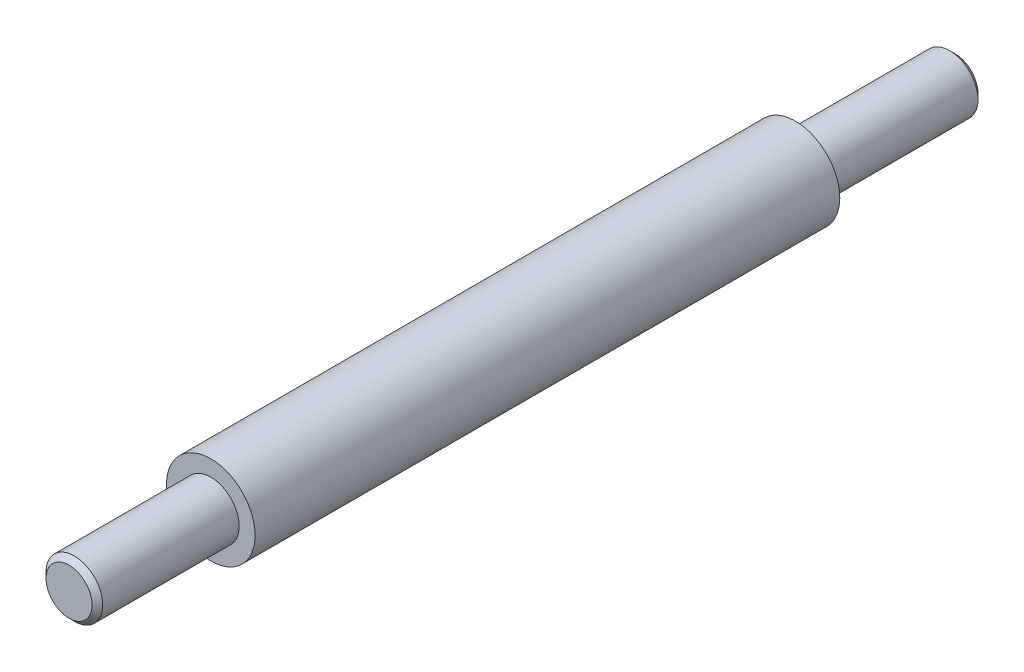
ISO-10303-21;
HEADER;
FILE_DESCRIPTION(('STEP AP214'),'2;1');
FILE_NAME('part.step','',(''),(''),'','','');
FILE_SCHEMA(('AUTOMOTIVE_DESIGN { 1 0 10303 214 1 1 1 1 }'));
ENDSEC;
DATA;
#1=APPLICATION_CONTEXT('core data for automotive mechanical design processes');
#2=APPLICATION_PROTOCOL_DEFINITION('international standard','automotive_design',2000,#1);
#3=PRODUCT_CONTEXT('',#1,'mechanical');
#4=PRODUCT('Part','Part','',(#3));
#5=PRODUCT_RELATED_PRODUCT_CATEGORY('part','',(#4));
#6=PRODUCT_DEFINITION_FORMATION('','',#4);
#7=PRODUCT_DEFINITION_CONTEXT('part definition',#1,'design');
#8=PRODUCT_DEFINITION('design','',#6,#7);
#9=PRODUCT_DEFINITION_SHAPE('','',#8);
#10=(LENGTH_UNIT() NAMED_UNIT(*) SI_UNIT(.MILLI.,.METRE.));
#11=(NAMED_UNIT(*) PLANE_ANGLE_UNIT() SI_UNIT($,.RADIAN.));
#12=(NAMED_UNIT(*) SI_UNIT($,.STERADIAN.) SOLID_ANGLE_UNIT());
#13=UNCERTAINTY_MEASURE_WITH_UNIT(LENGTH_MEASURE(1.E-05),#10,'distance_accuracy_value','');
#14=(GEOMETRIC_REPRESENTATION_CONTEXT(3) GLOBAL_UNCERTAINTY_ASSIGNED_CONTEXT((#13)) GLOBAL_UNIT_ASSIGNED_CONTEXT((#10,
#11,#12)) REPRESENTATION_CONTEXT('',''));
#15=CARTESIAN_POINT('',(0.,0.,0.));
#16=DIRECTION('',(0.,0.,1.));
#17=DIRECTION('',(1.,0.,0.));
#18=AXIS2_PLACEMENT_3D('',#15,#16,#17);
#19=CARTESIAN_POINT('',(0.,0.,165.));
#20=DIRECTION('',(0.,0.,-1.));
#21=DIRECTION('',(-1.,0.,0.));
#22=AXIS2_PLACEMENT_3D('',#19,#20,#21);
#23=CYLINDRICAL_SURFACE('',#22,12.5);
#24=CARTESIAN_POINT('',(0.,0.,165.));
#25=DIRECTION('',(0.,0.,1.));
#26=DIRECTION('',(1.,0.,0.));
#27=AXIS2_PLACEMENT_3D('',#24,#25,#26);
#28=CIRCLE('',#27,12.5);
#29=CARTESIAN_POINT('',(12.5,0.,165.));
#30=VERTEX_POINT('',#29);
#31=EDGE_CURVE('E54',#30,#30,#28,.T.);
#32=ORIENTED_EDGE('',*,*,#31,.F.);
#33=EDGE_LOOP('',(#32));
#34=FACE_BOUND('',#33,.T.);
#35=CARTESIAN_POINT('',(0.,0.,0.));
#36=DIRECTION('',(0.,0.,1.));
#37=DIRECTION('',(1.,0.,0.));
#38=AXIS2_PLACEMENT_3D('',#35,#36,#37);
#39=CIRCLE('',#38,12.5);
#40=CARTESIAN_POINT('',(12.5,0.,0.));
#41=VERTEX_POINT('',#40);
#42=EDGE_CURVE('E55',#41,#41,#39,.T.);
#43=ORIENTED_EDGE('',*,*,#42,.T.);
#44=EDGE_LOOP('',(#43));
#45=FACE_BOUND('',#44,.T.);
#46=ADVANCED_FACE('F31',(#34,#45),#23,.T.);
#47=CARTESIAN_POINT('',(0.,0.,165.));
#48=DIRECTION('',(0.,0.,1.));
#49=DIRECTION('',(1.,0.,0.));
#50=AXIS2_PLACEMENT_3D('',#47,#48,#49);
#51=PLANE('',#50);
#52=CARTESIAN_POINT('',(0.,0.,165.));
#53=DIRECTION('',(0.,0.,1.));
#54=DIRECTION('',(1.,0.,0.));
#55=AXIS2_PLACEMENT_3D('',#52,#53,#54);
#56=CIRCLE('',#55,8.);
#57=CARTESIAN_POINT('',(8.,0.,165.));
#58=VERTEX_POINT('',#57);
#59=EDGE_CURVE('E58',#58,#58,#56,.T.);
#60=ORIENTED_EDGE('',*,*,#59,.F.);
#61=EDGE_LOOP('',(#60));
#62=FACE_BOUND('',#61,.T.);
#63=ORIENTED_EDGE('',*,*,#31,.T.);
#64=EDGE_LOOP('',(#63));
#65=FACE_BOUND('',#64,.T.);
#66=ADVANCED_FACE('F66',(#62,#65),#51,.T.);
#67=CARTESIAN_POINT('',(0.,0.,0.));
#68=DIRECTION('',(0.,0.,1.));
#69=DIRECTION('',(1.,0.,0.));
#70=AXIS2_PLACEMENT_3D('',#67,#68,#69);
#71=PLANE('',#70);
#72=CARTESIAN_POINT('',(0.,0.,0.));
#73=DIRECTION('',(0.,0.,1.));
#74=DIRECTION('',(1.,0.,0.));
#75=AXIS2_PLACEMENT_3D('',#72,#73,#74);
#76=CIRCLE('',#75,8.);
#77=CARTESIAN_POINT('',(8.,0.,0.));
#78=VERTEX_POINT('',#77);
#79=EDGE_CURVE('E51',#78,#78,#76,.F.);
#80=ORIENTED_EDGE('',*,*,#79,.F.);
#81=EDGE_LOOP('',(#80));
#82=FACE_BOUND('',#81,.T.);
#83=ORIENTED_EDGE('',*,*,#42,.F.);
#84=EDGE_LOOP('',(#83));
#85=FACE_BOUND('',#84,.T.);
#86=ADVANCED_FACE('F69',(#82,#85),#71,.F.);
#87=CARTESIAN_POINT('',(0.,0.,-45.));
#88=DIRECTION('',(0.,0.,1.));
#89=DIRECTION('',(1.,0.,0.));
#90=AXIS2_PLACEMENT_3D('',#87,#88,#89);
#91=CYLINDRICAL_SURFACE('',#90,8.);
#92=CARTESIAN_POINT('',(0.,0.,-43.5000000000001));
#93=DIRECTION('',(0.,0.,-1.));
#94=DIRECTION('',(-1.,0.,0.));
#95=AXIS2_PLACEMENT_3D('',#92,#93,#94);
#96=CIRCLE('',#95,8.);
#97=CARTESIAN_POINT('',(8.,0.,-43.5000000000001));
#98=VERTEX_POINT('',#97);
#99=EDGE_CURVE('E42',#98,#98,#96,.F.);
#100=CARTESIAN_POINT('',(8.,0.,-43.5000000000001));
#101=CARTESIAN_POINT('',(8.,0.,-43.0468750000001));
#102=CARTESIAN_POINT('',(8.,0.,-42.5937500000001));
#103=CARTESIAN_POINT('',(8.,0.,-41.6875000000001));
#104=CARTESIAN_POINT('',(8.,0.,-41.2343750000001));
#105=CARTESIAN_POINT('',(8.,0.,-40.3281250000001));
#106=CARTESIAN_POINT('',(8.,0.,-39.8750000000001));
#107=CARTESIAN_POINT('',(8.,0.,-38.9687500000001));
#108=CARTESIAN_POINT('',(8.,0.,-38.5156250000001));
#109=CARTESIAN_POINT('',(8.,0.,-37.6093750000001));
#110=CARTESIAN_POINT('',(8.,0.,-37.1562500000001));
#111=CARTESIAN_POINT('',(8.,0.,-36.2500000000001));
#112=CARTESIAN_POINT('',(8.,0.,-35.7968750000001));
#113=CARTESIAN_POINT('',(8.,0.,-34.8906250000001));
#114=CARTESIAN_POINT('',(8.,0.,-34.4375000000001));
#115=CARTESIAN_POINT('',(8.,0.,-33.5312500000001));
#116=CARTESIAN_POINT('',(8.,0.,-33.0781250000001));
#117=CARTESIAN_POINT('',(8.,0.,-32.1718750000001));
#118=CARTESIAN_POINT('',(8.,0.,-31.7187500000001));
#119=CARTESIAN_POINT('',(8.,0.,-30.8125000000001));
#120=CARTESIAN_POINT('',(8.,0.,-30.3593750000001));
#121=CARTESIAN_POINT('',(8.,0.,-29.4531250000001));
#122=CARTESIAN_POINT('',(8.,0.,-29.0000000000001));
#123=CARTESIAN_POINT('',(8.,0.,-28.0937500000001));
#124=CARTESIAN_POINT('',(8.,0.,-27.6406250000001));
#125=CARTESIAN_POINT('',(8.,0.,-26.7343750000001));
#126=CARTESIAN_POINT('',(8.,0.,-26.2812500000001));
#127=CARTESIAN_POINT('',(8.,0.,-25.3750000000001));
#128=CARTESIAN_POINT('',(8.,0.,-24.9218750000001));
#129=CARTESIAN_POINT('',(8.,0.,-24.0156250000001));
#130=CARTESIAN_POINT('',(8.,0.,-23.5625000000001));
#131=CARTESIAN_POINT('',(8.,0.,-22.6562500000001));
#132=CARTESIAN_POINT('',(8.,0.,-22.2031250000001));
#133=CARTESIAN_POINT('',(8.,0.,-21.2968750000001));
#134=CARTESIAN_POINT('',(8.,0.,-20.8437500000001));
#135=CARTESIAN_POINT('',(8.,0.,-19.9375000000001));
#136=CARTESIAN_POINT('',(8.,0.,-19.4843750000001));
#137=CARTESIAN_POINT('',(8.,0.,-18.5781250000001));
#138=CARTESIAN_POINT('',(8.,0.,-18.1250000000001));
#139=CARTESIAN_POINT('',(8.,0.,-17.21875));
#140=CARTESIAN_POINT('',(8.,0.,-16.765625));
#141=CARTESIAN_POINT('',(8.,0.,-15.859375));
#142=CARTESIAN_POINT('',(8.,0.,-15.40625));
#143=CARTESIAN_POINT('',(8.,0.,-14.5));
#144=CARTESIAN_POINT('',(8.,0.,-14.046875));
#145=CARTESIAN_POINT('',(8.,0.,-13.140625));
#146=CARTESIAN_POINT('',(8.,0.,-12.6875));
#147=CARTESIAN_POINT('',(8.,0.,-11.78125));
#148=CARTESIAN_POINT('',(8.,0.,-11.328125));
#149=CARTESIAN_POINT('',(8.,0.,-10.421875));
#150=CARTESIAN_POINT('',(8.,0.,-9.96875000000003));
#151=CARTESIAN_POINT('',(8.,0.,-9.06250000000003));
#152=CARTESIAN_POINT('',(8.,0.,-8.60937500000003));
#153=CARTESIAN_POINT('',(8.,0.,-7.70312500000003));
#154=CARTESIAN_POINT('',(8.,0.,-7.25000000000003));
#155=CARTESIAN_POINT('',(8.,0.,-6.34375000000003));
#156=CARTESIAN_POINT('',(8.,0.,-5.89062500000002));
#157=CARTESIAN_POINT('',(8.,0.,-4.98437500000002));
#158=CARTESIAN_POINT('',(8.,0.,-4.53125000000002));
#159=CARTESIAN_POINT('',(8.,0.,-3.62500000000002));
#160=CARTESIAN_POINT('',(8.,0.,-3.17187500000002));
#161=CARTESIAN_POINT('',(8.,0.,-2.26562500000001));
#162=CARTESIAN_POINT('',(8.,0.,-1.81250000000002));
#163=CARTESIAN_POINT('',(8.,0.,-0.906250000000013));
#164=CARTESIAN_POINT('',(8.,0.,-0.45312500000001));
#165=CARTESIAN_POINT('',(8.,0.,0.));
#166=B_SPLINE_CURVE_WITH_KNOTS('',3,(#100,#101,#102,#103,#104,#105,#106,#107,#108,#109,#110,
#111,#112,#113,#114,#115,#116,#117,#118,#119,#120,#121,#122,#123,#124,#125,#126,#127,#128,#129,
#130,#131,#132,#133,#134,#135,#136,#137,#138,#139,#140,#141,#142,#143,#144,#145,#146,#147,#148,
#149,#150,#151,#152,#153,#154,#155,#156,#157,#158,#159,#160,#161,#162,#163,#164,#165),
.UNSPECIFIED.,.F.,.F.,(4,2,2,2,2,2,2,2,2,2,2,2,2,2,2,2,2,2,2,2,2,2,2,2,2,2,2,2,2,2,2,2,4),(0.,
1.359375,2.71875000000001,4.07812500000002,5.43750000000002,6.79687500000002,8.15625000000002,
9.51562500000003,10.875,12.234375,13.59375,14.953125,16.3125,17.671875,19.03125,20.390625,
21.7500000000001,23.1093750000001,24.4687500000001,25.8281250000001,27.1875000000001,
28.5468750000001,29.9062500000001,31.2656250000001,32.6250000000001,33.9843750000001,
35.3437500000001,36.7031250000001,38.0625000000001,39.4218750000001,40.7812500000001,
42.1406250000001,43.5000000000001),.UNSPECIFIED.);
#167=EDGE_CURVE('BSEAM79',#98,#78,#166,.T.);
#168=ORIENTED_EDGE('',*,*,#99,.T.);
#169=ORIENTED_EDGE('',*,*,#79,.T.);
#170=ORIENTED_EDGE('',*,*,#167,.T.);
#171=ORIENTED_EDGE('',*,*,#167,.F.);
#172=EDGE_LOOP('',(#168,#170,#169,#171));
#173=FACE_BOUND('',#172,.T.);
#174=ADVANCED_FACE('F79',(#173),#91,.T.);
#175=CARTESIAN_POINT('',(0.,0.,-45.));
#176=DIRECTION('',(0.,0.,-1.));
#177=DIRECTION('',(-1.,0.,0.));
#178=AXIS2_PLACEMENT_3D('',#175,#176,#177);
#179=PLANE('',#178);
#180=CARTESIAN_POINT('',(0.,0.,-45.));
#181=DIRECTION('',(0.,0.,-1.));
#182=DIRECTION('',(-1.,0.,0.));
#183=AXIS2_PLACEMENT_3D('',#180,#181,#182);
#184=CIRCLE('',#183,6.50000000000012);
#185=CARTESIAN_POINT('',(-6.50000000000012,0.,-45.));
#186=VERTEX_POINT('',#185);
#187=EDGE_CURVE('E46',#186,#186,#184,.T.);
#188=ORIENTED_EDGE('',*,*,#187,.T.);
#189=EDGE_LOOP('',(#188));
#190=FACE_BOUND('',#189,.T.);
#191=ADVANCED_FACE('F85',(#190),#179,.T.);
#192=CARTESIAN_POINT('',(0.,0.,-45.));
#193=DIRECTION('',(0.,0.,1.));
#194=DIRECTION('',(1.,0.,0.));
#195=AXIS2_PLACEMENT_3D('',#192,#193,#194);
#196=CONICAL_SURFACE('',#195,6.50000000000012,0.785398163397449);
#197=ORIENTED_EDGE('',*,*,#99,.F.);
#198=EDGE_LOOP('',(#197));
#199=FACE_BOUND('',#198,.T.);
#200=ORIENTED_EDGE('',*,*,#187,.F.);
#201=EDGE_LOOP('',(#200));
#202=FACE_BOUND('',#201,.T.);
#203=ADVANCED_FACE('F89',(#199,#202),#196,.T.);
#204=CARTESIAN_POINT('',(0.,0.,205.));
#205=DIRECTION('',(0.,0.,-1.));
#206=DIRECTION('',(-1.,0.,0.));
#207=AXIS2_PLACEMENT_3D('',#204,#205,#206);
#208=CYLINDRICAL_SURFACE('',#207,8.);
#209=CARTESIAN_POINT('',(0.,0.,203.5));
#210=DIRECTION('',(0.,0.,1.));
#211=DIRECTION('',(1.,0.,0.));
#212=AXIS2_PLACEMENT_3D('',#209,#210,#211);
#213=CIRCLE('',#212,8.);
#214=CARTESIAN_POINT('',(8.,0.,203.5));
#215=VERTEX_POINT('',#214);
#216=EDGE_CURVE('E10',#215,#215,#213,.F.);
#217=ORIENTED_EDGE('',*,*,#216,.T.);
#218=EDGE_LOOP('',(#217));
#219=FACE_BOUND('',#218,.T.);
#220=ORIENTED_EDGE('',*,*,#59,.T.);
#221=EDGE_LOOP('',(#220));
#222=FACE_BOUND('',#221,.T.);
#223=ADVANCED_FACE('F64',(#219,#222),#208,.T.);
#224=CARTESIAN_POINT('',(0.,0.,205.));
#225=DIRECTION('',(0.,0.,1.));
#226=DIRECTION('',(1.,0.,0.));
#227=AXIS2_PLACEMENT_3D('',#224,#225,#226);
#228=PLANE('',#227);
#229=CARTESIAN_POINT('',(0.,0.,205.));
#230=DIRECTION('',(0.,0.,1.));
#231=DIRECTION('',(1.,0.,0.));
#232=AXIS2_PLACEMENT_3D('',#229,#230,#231);
#233=CIRCLE('',#232,6.49999999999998);
#234=CARTESIAN_POINT('',(6.49999999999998,0.,205.));
#235=VERTEX_POINT('',#234);
#236=EDGE_CURVE('E38',#235,#235,#233,.T.);
#237=ORIENTED_EDGE('',*,*,#236,.T.);
#238=EDGE_LOOP('',(#237));
#239=FACE_BOUND('',#238,.T.);
#240=ADVANCED_FACE('F96',(#239),#228,.T.);
#241=CARTESIAN_POINT('',(0.,0.,205.));
#242=DIRECTION('',(0.,0.,-1.));
#243=DIRECTION('',(-1.,0.,0.));
#244=AXIS2_PLACEMENT_3D('',#241,#242,#243);
#245=CONICAL_SURFACE('',#244,6.49999999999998,0.785398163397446);
#246=ORIENTED_EDGE('',*,*,#216,.F.);
#247=EDGE_LOOP('',(#246));
#248=FACE_BOUND('',#247,.T.);
#249=ORIENTED_EDGE('',*,*,#236,.F.);
#250=EDGE_LOOP('',(#249));
#251=FACE_BOUND('',#250,.T.);
#252=ADVANCED_FACE('F33',(#248,#251),#245,.T.);
#253=CLOSED_SHELL('',(#46,#66,#86,#174,#191,#203,#223,#240,#252));
#254=MANIFOLD_SOLID_BREP('B2',#253);
#255=ADVANCED_BREP_SHAPE_REPRESENTATION('',(#18,#254),#14);
#256=SHAPE_DEFINITION_REPRESENTATION(#9,#255);
ENDSEC;
END-ISO-10303-21;
